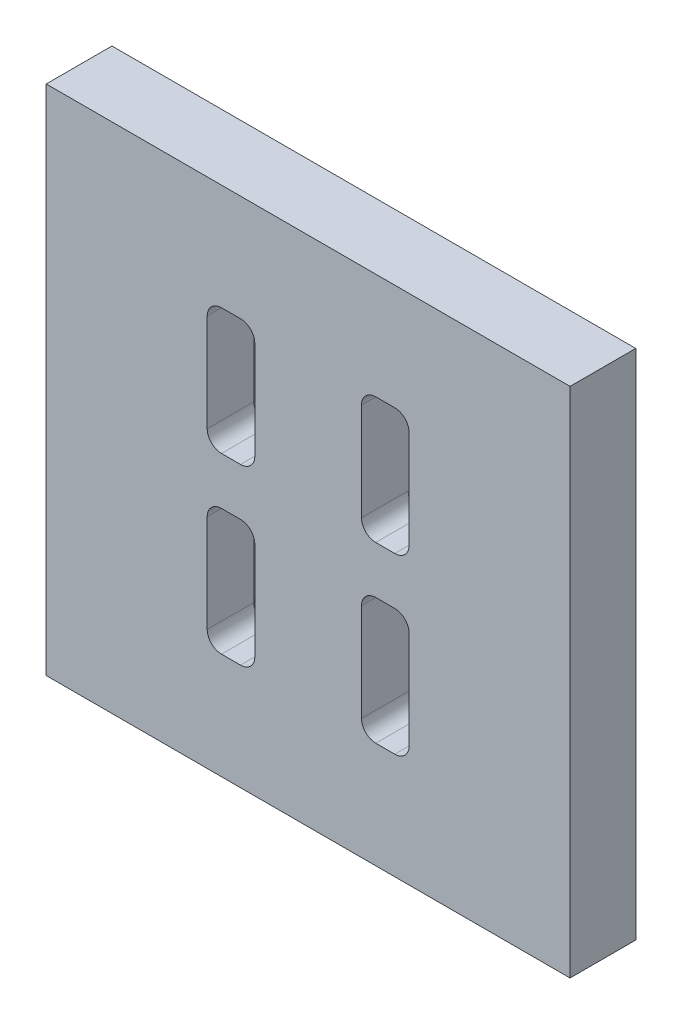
from build123d import *

# Parameters (mm, degrees)
SKETCH1_W           = 69.85
SKETCH1_H           = 68.326
BOSS_EXTRUDE1_DEPTH = 8.763
CUT_EXTRUDE3_DEPTH  = 2.54
CUT_EXTRUDE1_DEPTH  = 99.103287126


with BuildPart() as part:
    # Sketch1 → Boss-Extrude1 (new body)
    with BuildSketch(Plane.XY):
        with Locations((34.925, 34.163)):
            Rectangle(SKETCH1_W, SKETCH1_H)
    extrude(amount=BOSS_EXTRUDE1_DEPTH)

    # Sketch5 → Cut-Extrude3 (cut)
    with BuildSketch(Plane(origin=(0, 0, 0), x_dir=(-1, 0, 0), z_dir=(0, 0, -1))):
        with BuildLine():
            Line((-27.813, 52.2605), (-27.813, 16.0655))
            ThreePointArc((-27.813, 16.0655), (-27.255038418, 14.718461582), (-25.908, 14.1605))
            Line((-25.908, 14.1605), (-10.668, 14.1605))
            ThreePointArc((-10.668, 14.1605), (-9.320961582, 14.718461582), (-8.763, 16.0655))
            Line((-8.763, 16.0655), (-8.763, 52.2605))
            ThreePointArc((-8.763, 52.2605), (-9.320961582, 53.607538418), (-10.668, 54.1655))
            Line((-10.668, 54.1655), (-25.908, 54.1655))
            ThreePointArc((-25.908, 54.1655), (-27.255038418, 53.607538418), (-27.813, 52.2605))
        make_face()
        with BuildLine():
            Line((-59.182, 54.1655), (-43.942, 54.1655))
            ThreePointArc((-43.942, 54.1655), (-42.594961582, 53.607538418), (-42.037, 52.2605))
            Line((-42.037, 52.2605), (-42.037, 16.0655))
            ThreePointArc((-42.037, 16.0655), (-42.594961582, 14.718461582), (-43.942, 14.1605))
            Line((-43.942, 14.1605), (-59.182, 14.1605))
            ThreePointArc((-59.182, 14.1605), (-60.529038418, 14.718461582), (-61.087, 16.0655))
            Line((-61.087, 16.0655), (-61.087, 52.2605))
            ThreePointArc((-61.087, 52.2605), (-60.529038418, 53.607538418), (-59.182, 54.1655))
        make_face()
    extrude(amount=-CUT_EXTRUDE3_DEPTH, mode=Mode.SUBTRACT)

    # Sketch3 → Cut-Extrude1 (cut, through all)
    with BuildSketch(Plane(origin=(0, 0, 0), x_dir=(-1, 0, 0), z_dir=(0, 0, -1))):
        with BuildLine():
            Line((-46.482, 54.1655), (-43.942, 54.1655))
            ThreePointArc((-43.942, 54.1655), (-42.594961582, 53.607538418), (-42.037, 52.2605))
            Line((-42.037, 52.2605), (-42.037, 39.243))
            ThreePointArc((-42.037, 39.243), (-42.594961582, 37.895961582), (-43.942, 37.338))
            Line((-43.942, 37.338), (-46.482, 37.338))
            ThreePointArc((-46.482, 37.338), (-47.829038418, 37.895961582), (-48.387, 39.243))
            Line((-48.387, 39.243), (-48.387, 52.2605))
            ThreePointArc((-48.387, 52.2605), (-47.829038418, 53.607538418), (-46.482, 54.1655))
        make_face()
        with BuildLine():
            Line((-23.368, 54.1655), (-25.908, 54.1655))
            ThreePointArc((-25.908, 54.1655), (-27.255038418, 53.607538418), (-27.813, 52.2605))
            Line((-27.813, 52.2605), (-27.813, 39.243))
            ThreePointArc((-27.813, 39.243), (-27.255038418, 37.895961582), (-25.908, 37.338))
            Line((-25.908, 37.338), (-23.368, 37.338))
            ThreePointArc((-23.368, 37.338), (-22.020961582, 37.895961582), (-21.463, 39.243))
            Line((-21.463, 39.243), (-21.463, 52.2605))
            ThreePointArc((-21.463, 52.2605), (-22.020961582, 53.607538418), (-23.368, 54.1655))
        make_face()
        with BuildLine():
            Line((-23.368, 14.1605), (-25.908, 14.1605))
            ThreePointArc((-25.908, 14.1605), (-27.255038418, 14.718461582), (-27.813, 16.0655))
            Line((-27.813, 16.0655), (-27.813, 29.083))
            ThreePointArc((-27.813, 29.083), (-27.255038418, 30.430038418), (-25.908, 30.988))
            Line((-25.908, 30.988), (-23.368, 30.988))
            ThreePointArc((-23.368, 30.988), (-22.020961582, 30.430038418), (-21.463, 29.083))
            Line((-21.463, 29.083), (-21.463, 16.0655))
            ThreePointArc((-21.463, 16.0655), (-22.020961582, 14.718461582), (-23.368, 14.1605))
        make_face()
        with BuildLine():
            Line((-46.482, 14.1605), (-43.942, 14.1605))
            ThreePointArc((-43.942, 14.1605), (-42.594961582, 14.718461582), (-42.037, 16.0655))
            Line((-42.037, 16.0655), (-42.037, 29.083))
            ThreePointArc((-42.037, 29.083), (-42.594961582, 30.430038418), (-43.942, 30.988))
            Line((-43.942, 30.988), (-46.482, 30.988))
            ThreePointArc((-46.482, 30.988), (-47.829038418, 30.430038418), (-48.387, 29.083))
            Line((-48.387, 29.083), (-48.387, 16.0655))
            ThreePointArc((-48.387, 16.0655), (-47.829038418, 14.718461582), (-46.482, 14.1605))
        make_face()
    extrude(amount=-CUT_EXTRUDE1_DEPTH, mode=Mode.SUBTRACT)


solid = part.part
